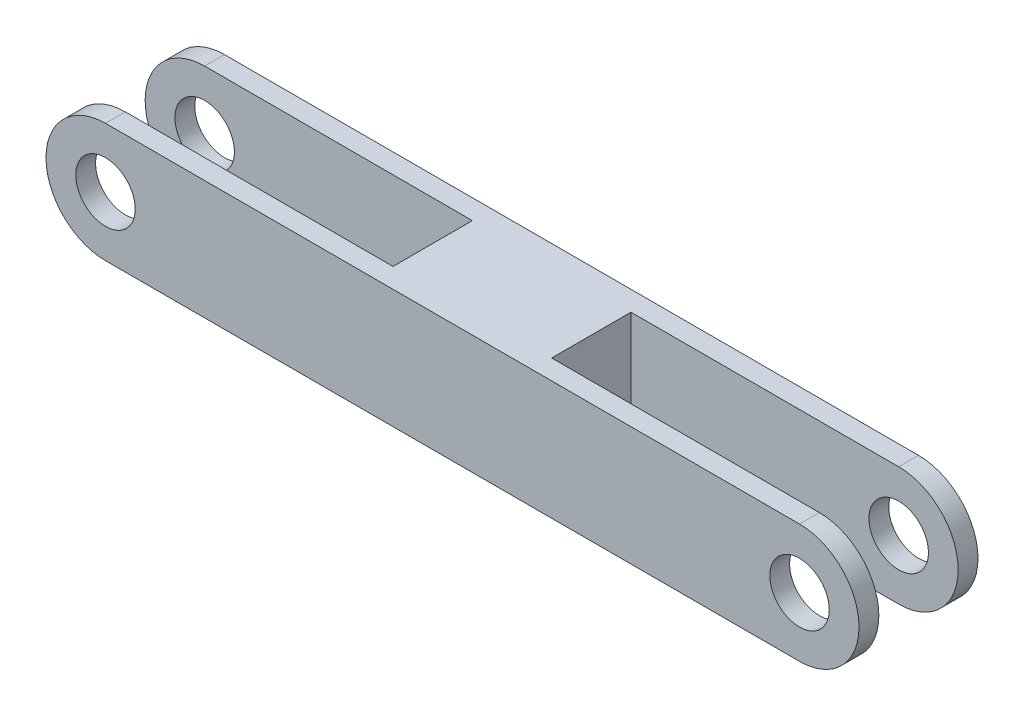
ISO-10303-21;
HEADER;
FILE_DESCRIPTION(('STEP AP214'),'2;1');
FILE_NAME('part.step','',(''),(''),'','','');
FILE_SCHEMA(('AUTOMOTIVE_DESIGN { 1 0 10303 214 1 1 1 1 }'));
ENDSEC;
DATA;
#1=APPLICATION_CONTEXT('core data for automotive mechanical design processes');
#2=APPLICATION_PROTOCOL_DEFINITION('international standard','automotive_design',2000,#1);
#3=PRODUCT_CONTEXT('',#1,'mechanical');
#4=PRODUCT('Part','Part','',(#3));
#5=PRODUCT_RELATED_PRODUCT_CATEGORY('part','',(#4));
#6=PRODUCT_DEFINITION_FORMATION('','',#4);
#7=PRODUCT_DEFINITION_CONTEXT('part definition',#1,'design');
#8=PRODUCT_DEFINITION('design','',#6,#7);
#9=PRODUCT_DEFINITION_SHAPE('','',#8);
#10=(LENGTH_UNIT() NAMED_UNIT(*) SI_UNIT(.MILLI.,.METRE.));
#11=(NAMED_UNIT(*) PLANE_ANGLE_UNIT() SI_UNIT($,.RADIAN.));
#12=(NAMED_UNIT(*) SI_UNIT($,.STERADIAN.) SOLID_ANGLE_UNIT());
#13=UNCERTAINTY_MEASURE_WITH_UNIT(LENGTH_MEASURE(1.E-05),#10,'distance_accuracy_value','');
#14=(GEOMETRIC_REPRESENTATION_CONTEXT(3) GLOBAL_UNCERTAINTY_ASSIGNED_CONTEXT((#13)) GLOBAL_UNIT_ASSIGNED_CONTEXT((#10,
#11,#12)) REPRESENTATION_CONTEXT('',''));
#15=CARTESIAN_POINT('',(0.,0.,0.));
#16=DIRECTION('',(0.,0.,1.));
#17=DIRECTION('',(1.,0.,0.));
#18=AXIS2_PLACEMENT_3D('',#15,#16,#17);
#19=CARTESIAN_POINT('',(0.,0.,3.));
#20=DIRECTION('',(0.,0.,-1.));
#21=DIRECTION('',(-1.,0.,0.));
#22=AXIS2_PLACEMENT_3D('',#19,#20,#21);
#23=CYLINDRICAL_SURFACE('',#22,3.);
#24=DIRECTION('',(0.,0.,-1.));
#25=VECTOR('',#24,1.);
#26=CARTESIAN_POINT('',(0.,3.,3.));
#27=LINE('',#26,#25);
#28=CARTESIAN_POINT('',(0.,3.,3.));
#29=VERTEX_POINT('',#28);
#30=CARTESIAN_POINT('',(0.,3.,2.));
#31=VERTEX_POINT('',#30);
#32=EDGE_CURVE('E139',#29,#31,#27,.T.);
#33=ORIENTED_EDGE('',*,*,#32,.T.);
#34=CARTESIAN_POINT('',(0.,0.,2.));
#35=DIRECTION('',(0.,0.,1.));
#36=DIRECTION('',(1.,0.,0.));
#37=AXIS2_PLACEMENT_3D('',#34,#35,#36);
#38=CIRCLE('',#37,3.);
#39=CARTESIAN_POINT('',(0.,-3.,2.));
#40=VERTEX_POINT('',#39);
#41=EDGE_CURVE('E127',#40,#31,#38,.F.);
#42=ORIENTED_EDGE('',*,*,#41,.F.);
#43=DIRECTION('',(0.,0.,-1.));
#44=VECTOR('',#43,1.);
#45=CARTESIAN_POINT('',(0.,-3.,3.));
#46=LINE('',#45,#44);
#47=CARTESIAN_POINT('',(0.,-3.,3.));
#48=VERTEX_POINT('',#47);
#49=EDGE_CURVE('E11',#48,#40,#46,.T.);
#50=ORIENTED_EDGE('',*,*,#49,.F.);
#51=CARTESIAN_POINT('',(0.,0.,3.));
#52=DIRECTION('',(0.,0.,1.));
#53=DIRECTION('',(-1.,0.,0.));
#54=AXIS2_PLACEMENT_3D('',#51,#52,#53);
#55=CIRCLE('',#54,3.);
#56=EDGE_CURVE('E153',#29,#48,#55,.T.);
#57=ORIENTED_EDGE('',*,*,#56,.F.);
#58=EDGE_LOOP('',(#33,#42,#50,#57));
#59=FACE_BOUND('',#58,.T.);
#60=ADVANCED_FACE('F33',(#59),#23,.T.);
#61=CARTESIAN_POINT('',(0.,0.,3.));
#62=DIRECTION('',(0.,0.,-1.));
#63=DIRECTION('',(-1.,0.,0.));
#64=AXIS2_PLACEMENT_3D('',#61,#62,#63);
#65=CYLINDRICAL_SURFACE('',#64,1.5);
#66=CARTESIAN_POINT('',(0.,0.,2.));
#67=DIRECTION('',(0.,0.,1.));
#68=DIRECTION('',(1.,0.,0.));
#69=AXIS2_PLACEMENT_3D('',#66,#67,#68);
#70=CIRCLE('',#69,1.5);
#71=CARTESIAN_POINT('',(1.5,0.,2.));
#72=VERTEX_POINT('',#71);
#73=EDGE_CURVE('E243',#72,#72,#70,.F.);
#74=ORIENTED_EDGE('',*,*,#73,.T.);
#75=EDGE_LOOP('',(#74));
#76=FACE_BOUND('',#75,.T.);
#77=CARTESIAN_POINT('',(0.,0.,3.));
#78=DIRECTION('',(0.,0.,1.));
#79=DIRECTION('',(1.,0.,0.));
#80=AXIS2_PLACEMENT_3D('',#77,#78,#79);
#81=CIRCLE('',#80,1.5);
#82=CARTESIAN_POINT('',(1.5,0.,3.));
#83=VERTEX_POINT('',#82);
#84=EDGE_CURVE('E200',#83,#83,#81,.T.);
#85=ORIENTED_EDGE('',*,*,#84,.T.);
#86=EDGE_LOOP('',(#85));
#87=FACE_BOUND('',#86,.T.);
#88=ADVANCED_FACE('F283',(#76,#87),#65,.F.);
#89=CARTESIAN_POINT('',(35.,0.,3.));
#90=DIRECTION('',(0.,0.,-1.));
#91=DIRECTION('',(-1.,0.,0.));
#92=AXIS2_PLACEMENT_3D('',#89,#90,#91);
#93=CYLINDRICAL_SURFACE('',#92,3.);
#94=DIRECTION('',(0.,0.,-1.));
#95=VECTOR('',#94,1.);
#96=CARTESIAN_POINT('',(35.,3.,3.));
#97=LINE('',#96,#95);
#98=CARTESIAN_POINT('',(35.,3.,-2.));
#99=VERTEX_POINT('',#98);
#100=CARTESIAN_POINT('',(35.,3.,-3.));
#101=VERTEX_POINT('',#100);
#102=EDGE_CURVE('E170',#99,#101,#97,.T.);
#103=ORIENTED_EDGE('',*,*,#102,.F.);
#104=CARTESIAN_POINT('',(35.,0.,-2.));
#105=DIRECTION('',(0.,0.,-1.));
#106=DIRECTION('',(-1.,0.,0.));
#107=AXIS2_PLACEMENT_3D('',#104,#105,#106);
#108=CIRCLE('',#107,3.);
#109=CARTESIAN_POINT('',(35.,-3.,-2.));
#110=VERTEX_POINT('',#109);
#111=EDGE_CURVE('E185',#110,#99,#108,.F.);
#112=ORIENTED_EDGE('',*,*,#111,.F.);
#113=DIRECTION('',(0.,0.,-1.));
#114=VECTOR('',#113,1.);
#115=CARTESIAN_POINT('',(35.,-3.,3.));
#116=LINE('',#115,#114);
#117=CARTESIAN_POINT('',(35.,-3.,-3.));
#118=VERTEX_POINT('',#117);
#119=EDGE_CURVE('E173',#110,#118,#116,.T.);
#120=ORIENTED_EDGE('',*,*,#119,.T.);
#121=CARTESIAN_POINT('',(35.,0.,-3.));
#122=DIRECTION('',(0.,0.,1.));
#123=DIRECTION('',(1.,0.,0.));
#124=AXIS2_PLACEMENT_3D('',#121,#122,#123);
#125=CIRCLE('',#124,3.);
#126=EDGE_CURVE('E162',#118,#101,#125,.T.);
#127=ORIENTED_EDGE('',*,*,#126,.T.);
#128=EDGE_LOOP('',(#103,#112,#120,#127));
#129=FACE_BOUND('',#128,.T.);
#130=ADVANCED_FACE('F182',(#129),#93,.T.);
#131=CARTESIAN_POINT('',(35.,0.,3.));
#132=DIRECTION('',(0.,0.,-1.));
#133=DIRECTION('',(-1.,0.,0.));
#134=AXIS2_PLACEMENT_3D('',#131,#132,#133);
#135=CYLINDRICAL_SURFACE('',#134,1.5);
#136=CARTESIAN_POINT('',(35.,0.,-2.));
#137=DIRECTION('',(0.,0.,-1.));
#138=DIRECTION('',(-1.,0.,0.));
#139=AXIS2_PLACEMENT_3D('',#136,#137,#138);
#140=CIRCLE('',#139,1.5);
#141=CARTESIAN_POINT('',(33.5,0.,-2.));
#142=VERTEX_POINT('',#141);
#143=EDGE_CURVE('E219',#142,#142,#140,.F.);
#144=ORIENTED_EDGE('',*,*,#143,.T.);
#145=EDGE_LOOP('',(#144));
#146=FACE_BOUND('',#145,.T.);
#147=CARTESIAN_POINT('',(35.,0.,-3.));
#148=DIRECTION('',(0.,0.,1.));
#149=DIRECTION('',(1.,0.,0.));
#150=AXIS2_PLACEMENT_3D('',#147,#148,#149);
#151=CIRCLE('',#150,1.5);
#152=CARTESIAN_POINT('',(36.5,0.,-3.));
#153=VERTEX_POINT('',#152);
#154=EDGE_CURVE('E209',#153,#153,#151,.T.);
#155=ORIENTED_EDGE('',*,*,#154,.F.);
#156=EDGE_LOOP('',(#155));
#157=FACE_BOUND('',#156,.T.);
#158=ADVANCED_FACE('F282',(#146,#157),#135,.F.);
#159=CARTESIAN_POINT('',(0.,0.,3.));
#160=DIRECTION('',(0.,0.,-1.));
#161=DIRECTION('',(-1.,0.,0.));
#162=AXIS2_PLACEMENT_3D('',#159,#160,#161);
#163=PLANE('',#162);
#164=ORIENTED_EDGE('',*,*,#84,.F.);
#165=EDGE_LOOP('',(#164));
#166=FACE_BOUND('',#165,.T.);
#167=ORIENTED_EDGE('',*,*,#56,.T.);
#168=DIRECTION('',(1.,0.,0.));
#169=VECTOR('',#168,1.);
#170=CARTESIAN_POINT('',(0.,-3.,3.));
#171=LINE('',#170,#169);
#172=CARTESIAN_POINT('',(35.,-3.,3.));
#173=VERTEX_POINT('',#172);
#174=EDGE_CURVE('E145',#48,#173,#171,.T.);
#175=ORIENTED_EDGE('',*,*,#174,.T.);
#176=CARTESIAN_POINT('',(35.,0.,3.));
#177=DIRECTION('',(0.,0.,1.));
#178=DIRECTION('',(1.,0.,0.));
#179=AXIS2_PLACEMENT_3D('',#176,#177,#178);
#180=CIRCLE('',#179,3.);
#181=CARTESIAN_POINT('',(35.,3.,3.));
#182=VERTEX_POINT('',#181);
#183=EDGE_CURVE('E152',#173,#182,#180,.T.);
#184=ORIENTED_EDGE('',*,*,#183,.T.);
#185=DIRECTION('',(-1.,0.,0.));
#186=VECTOR('',#185,1.);
#187=CARTESIAN_POINT('',(0.,3.,3.));
#188=LINE('',#187,#186);
#189=EDGE_CURVE('E158',#182,#29,#188,.T.);
#190=ORIENTED_EDGE('',*,*,#189,.T.);
#191=EDGE_LOOP('',(#167,#175,#184,#190));
#192=FACE_BOUND('',#191,.T.);
#193=CARTESIAN_POINT('',(35.,0.,3.));
#194=DIRECTION('',(0.,0.,1.));
#195=DIRECTION('',(1.,0.,0.));
#196=AXIS2_PLACEMENT_3D('',#193,#194,#195);
#197=CIRCLE('',#196,1.5);
#198=CARTESIAN_POINT('',(36.5,0.,3.));
#199=VERTEX_POINT('',#198);
#200=EDGE_CURVE('E206',#199,#199,#197,.T.);
#201=ORIENTED_EDGE('',*,*,#200,.F.);
#202=EDGE_LOOP('',(#201));
#203=FACE_BOUND('',#202,.T.);
#204=ADVANCED_FACE('F155',(#166,#192,#203),#163,.F.);
#205=CARTESIAN_POINT('',(0.,0.,-3.));
#206=DIRECTION('',(0.,0.,-1.));
#207=DIRECTION('',(-1.,0.,0.));
#208=AXIS2_PLACEMENT_3D('',#205,#206,#207);
#209=PLANE('',#208);
#210=CARTESIAN_POINT('',(0.,0.,-3.));
#211=DIRECTION('',(0.,0.,1.));
#212=DIRECTION('',(1.,0.,0.));
#213=AXIS2_PLACEMENT_3D('',#210,#211,#212);
#214=CIRCLE('',#213,1.5);
#215=CARTESIAN_POINT('',(1.5,0.,-3.));
#216=VERTEX_POINT('',#215);
#217=EDGE_CURVE('E203',#216,#216,#214,.T.);
#218=ORIENTED_EDGE('',*,*,#217,.T.);
#219=EDGE_LOOP('',(#218));
#220=FACE_BOUND('',#219,.T.);
#221=CARTESIAN_POINT('',(0.,0.,-3.));
#222=DIRECTION('',(0.,0.,1.));
#223=DIRECTION('',(-1.,0.,0.));
#224=AXIS2_PLACEMENT_3D('',#221,#222,#223);
#225=CIRCLE('',#224,3.);
#226=CARTESIAN_POINT('',(0.,3.,-3.));
#227=VERTEX_POINT('',#226);
#228=CARTESIAN_POINT('',(0.,-3.,-3.));
#229=VERTEX_POINT('',#228);
#230=EDGE_CURVE('E194',#227,#229,#225,.T.);
#231=ORIENTED_EDGE('',*,*,#230,.F.);
#232=DIRECTION('',(-1.,0.,0.));
#233=VECTOR('',#232,1.);
#234=CARTESIAN_POINT('',(0.,3.,-3.));
#235=LINE('',#234,#233);
#236=EDGE_CURVE('E159',#101,#227,#235,.T.);
#237=ORIENTED_EDGE('',*,*,#236,.F.);
#238=ORIENTED_EDGE('',*,*,#126,.F.);
#239=DIRECTION('',(1.,0.,0.));
#240=VECTOR('',#239,1.);
#241=CARTESIAN_POINT('',(0.,-3.,-3.));
#242=LINE('',#241,#240);
#243=EDGE_CURVE('E188',#229,#118,#242,.T.);
#244=ORIENTED_EDGE('',*,*,#243,.F.);
#245=EDGE_LOOP('',(#231,#237,#238,#244));
#246=FACE_BOUND('',#245,.T.);
#247=ORIENTED_EDGE('',*,*,#154,.T.);
#248=EDGE_LOOP('',(#247));
#249=FACE_BOUND('',#248,.T.);
#250=ADVANCED_FACE('F196',(#220,#246,#249),#209,.T.);
#251=CARTESIAN_POINT('',(0.,-3.,-2.));
#252=VERTEX_POINT('',#251);
#253=EDGE_CURVE('E41',#252,#229,#46,.T.);
#254=ORIENTED_EDGE('',*,*,#253,.F.);
#255=CARTESIAN_POINT('',(0.,0.,-2.));
#256=DIRECTION('',(0.,0.,-1.));
#257=DIRECTION('',(-1.,0.,0.));
#258=AXIS2_PLACEMENT_3D('',#255,#256,#257);
#259=CIRCLE('',#258,3.);
#260=CARTESIAN_POINT('',(0.,3.,-2.));
#261=VERTEX_POINT('',#260);
#262=EDGE_CURVE('E141',#261,#252,#259,.F.);
#263=ORIENTED_EDGE('',*,*,#262,.F.);
#264=EDGE_CURVE('E168',#261,#227,#27,.T.);
#265=ORIENTED_EDGE('',*,*,#264,.T.);
#266=ORIENTED_EDGE('',*,*,#230,.T.);
#267=EDGE_LOOP('',(#254,#263,#265,#266));
#268=FACE_BOUND('',#267,.T.);
#269=ADVANCED_FACE('F35',(#268),#23,.T.);
#270=CARTESIAN_POINT('',(0.,-3.,3.));
#271=DIRECTION('',(0.,1.,0.));
#272=DIRECTION('',(0.,0.,1.));
#273=AXIS2_PLACEMENT_3D('',#270,#271,#272);
#274=PLANE('',#273);
#275=ORIENTED_EDGE('',*,*,#49,.T.);
#276=DIRECTION('',(-1.,0.,0.));
#277=VECTOR('',#276,1.);
#278=CARTESIAN_POINT('',(13.5,-3.,2.));
#279=LINE('',#278,#277);
#280=CARTESIAN_POINT('',(13.5,-3.,2.));
#281=VERTEX_POINT('',#280);
#282=EDGE_CURVE('E123',#281,#40,#279,.T.);
#283=ORIENTED_EDGE('',*,*,#282,.F.);
#284=DIRECTION('',(0.,0.,1.));
#285=VECTOR('',#284,1.);
#286=CARTESIAN_POINT('',(13.5,-3.,-2.));
#287=LINE('',#286,#285);
#288=CARTESIAN_POINT('',(13.5,-3.,-2.));
#289=VERTEX_POINT('',#288);
#290=EDGE_CURVE('E132',#289,#281,#287,.T.);
#291=ORIENTED_EDGE('',*,*,#290,.F.);
#292=DIRECTION('',(1.,0.,0.));
#293=VECTOR('',#292,1.);
#294=CARTESIAN_POINT('',(-3.,-3.,-2.));
#295=LINE('',#294,#293);
#296=EDGE_CURVE('E239',#252,#289,#295,.T.);
#297=ORIENTED_EDGE('',*,*,#296,.F.);
#298=ORIENTED_EDGE('',*,*,#253,.T.);
#299=ORIENTED_EDGE('',*,*,#243,.T.);
#300=ORIENTED_EDGE('',*,*,#119,.F.);
#301=DIRECTION('',(1.,0.,0.));
#302=VECTOR('',#301,1.);
#303=CARTESIAN_POINT('',(38.,-3.,-2.));
#304=LINE('',#303,#302);
#305=CARTESIAN_POINT('',(21.5,-3.,-2.));
#306=VERTEX_POINT('',#305);
#307=EDGE_CURVE('E229',#306,#110,#304,.T.);
#308=ORIENTED_EDGE('',*,*,#307,.F.);
#309=DIRECTION('',(0.,0.,-1.));
#310=VECTOR('',#309,1.);
#311=CARTESIAN_POINT('',(21.5,-3.,-2.));
#312=LINE('',#311,#310);
#313=CARTESIAN_POINT('',(21.5,-3.,2.));
#314=VERTEX_POINT('',#313);
#315=EDGE_CURVE('E231',#314,#306,#312,.T.);
#316=ORIENTED_EDGE('',*,*,#315,.F.);
#317=DIRECTION('',(-1.,0.,0.));
#318=VECTOR('',#317,1.);
#319=CARTESIAN_POINT('',(21.5,-3.,2.));
#320=LINE('',#319,#318);
#321=CARTESIAN_POINT('',(35.,-3.,2.));
#322=VERTEX_POINT('',#321);
#323=EDGE_CURVE('E212',#322,#314,#320,.T.);
#324=ORIENTED_EDGE('',*,*,#323,.F.);
#325=EDGE_CURVE('E149',#173,#322,#116,.T.);
#326=ORIENTED_EDGE('',*,*,#325,.F.);
#327=ORIENTED_EDGE('',*,*,#174,.F.);
#328=EDGE_LOOP('',(#275,#283,#291,#297,#298,#299,#300,#308,#316,#324,#326,#327));
#329=FACE_BOUND('',#328,.T.);
#330=ADVANCED_FACE('F143',(#329),#274,.F.);
#331=ORIENTED_EDGE('',*,*,#325,.T.);
#332=CARTESIAN_POINT('',(35.,0.,2.));
#333=DIRECTION('',(0.,0.,1.));
#334=DIRECTION('',(1.,0.,0.));
#335=AXIS2_PLACEMENT_3D('',#332,#333,#334);
#336=CIRCLE('',#335,3.);
#337=CARTESIAN_POINT('',(35.,3.,2.));
#338=VERTEX_POINT('',#337);
#339=EDGE_CURVE('E237',#338,#322,#336,.F.);
#340=ORIENTED_EDGE('',*,*,#339,.F.);
#341=EDGE_CURVE('E171',#182,#338,#97,.T.);
#342=ORIENTED_EDGE('',*,*,#341,.F.);
#343=ORIENTED_EDGE('',*,*,#183,.F.);
#344=EDGE_LOOP('',(#331,#340,#342,#343));
#345=FACE_BOUND('',#344,.T.);
#346=ADVANCED_FACE('F272',(#345),#93,.T.);
#347=CARTESIAN_POINT('',(0.,3.,3.));
#348=DIRECTION('',(0.,-1.,0.));
#349=DIRECTION('',(0.,0.,-1.));
#350=AXIS2_PLACEMENT_3D('',#347,#348,#349);
#351=PLANE('',#350);
#352=DIRECTION('',(0.,0.,-1.));
#353=VECTOR('',#352,1.);
#354=CARTESIAN_POINT('',(13.5,3.,-2.));
#355=LINE('',#354,#353);
#356=CARTESIAN_POINT('',(13.5,3.,2.));
#357=VERTEX_POINT('',#356);
#358=CARTESIAN_POINT('',(13.5,3.,-2.));
#359=VERTEX_POINT('',#358);
#360=EDGE_CURVE('E48',#357,#359,#355,.T.);
#361=ORIENTED_EDGE('',*,*,#360,.F.);
#362=DIRECTION('',(1.,0.,0.));
#363=VECTOR('',#362,1.);
#364=CARTESIAN_POINT('',(13.5,3.,2.));
#365=LINE('',#364,#363);
#366=EDGE_CURVE('E246',#31,#357,#365,.T.);
#367=ORIENTED_EDGE('',*,*,#366,.F.);
#368=ORIENTED_EDGE('',*,*,#32,.F.);
#369=ORIENTED_EDGE('',*,*,#189,.F.);
#370=ORIENTED_EDGE('',*,*,#341,.T.);
#371=DIRECTION('',(1.,0.,0.));
#372=VECTOR('',#371,1.);
#373=CARTESIAN_POINT('',(21.5,3.,2.));
#374=LINE('',#373,#372);
#375=CARTESIAN_POINT('',(21.5,3.,2.));
#376=VERTEX_POINT('',#375);
#377=EDGE_CURVE('E226',#376,#338,#374,.T.);
#378=ORIENTED_EDGE('',*,*,#377,.F.);
#379=DIRECTION('',(0.,0.,1.));
#380=VECTOR('',#379,1.);
#381=CARTESIAN_POINT('',(21.5,3.,-2.));
#382=LINE('',#381,#380);
#383=CARTESIAN_POINT('',(21.5,3.,-2.));
#384=VERTEX_POINT('',#383);
#385=EDGE_CURVE('E56',#384,#376,#382,.T.);
#386=ORIENTED_EDGE('',*,*,#385,.F.);
#387=DIRECTION('',(-1.,0.,0.));
#388=VECTOR('',#387,1.);
#389=CARTESIAN_POINT('',(38.,3.,-2.));
#390=LINE('',#389,#388);
#391=EDGE_CURVE('E222',#99,#384,#390,.T.);
#392=ORIENTED_EDGE('',*,*,#391,.F.);
#393=ORIENTED_EDGE('',*,*,#102,.T.);
#394=ORIENTED_EDGE('',*,*,#236,.T.);
#395=ORIENTED_EDGE('',*,*,#264,.F.);
#396=DIRECTION('',(-1.,0.,0.));
#397=VECTOR('',#396,1.);
#398=CARTESIAN_POINT('',(-3.,3.,-2.));
#399=LINE('',#398,#397);
#400=EDGE_CURVE('E249',#359,#261,#399,.T.);
#401=ORIENTED_EDGE('',*,*,#400,.F.);
#402=EDGE_LOOP('',(#361,#367,#368,#369,#370,#378,#386,#392,#393,#394,#395,#401));
#403=FACE_BOUND('',#402,.T.);
#404=ADVANCED_FACE('F262',(#403),#351,.F.);
#405=CARTESIAN_POINT('',(0.,0.,-2.));
#406=DIRECTION('',(0.,0.,-1.));
#407=DIRECTION('',(-1.,0.,0.));
#408=AXIS2_PLACEMENT_3D('',#405,#406,#407);
#409=CIRCLE('',#408,1.5);
#410=CARTESIAN_POINT('',(-1.5,0.,-2.));
#411=VERTEX_POINT('',#410);
#412=EDGE_CURVE('E140',#411,#411,#409,.F.);
#413=ORIENTED_EDGE('',*,*,#412,.T.);
#414=EDGE_LOOP('',(#413));
#415=FACE_BOUND('',#414,.T.);
#416=ORIENTED_EDGE('',*,*,#217,.F.);
#417=EDGE_LOOP('',(#416));
#418=FACE_BOUND('',#417,.T.);
#419=ADVANCED_FACE('F279',(#415,#418),#65,.F.);
#420=CARTESIAN_POINT('',(35.,0.,2.));
#421=DIRECTION('',(0.,0.,1.));
#422=DIRECTION('',(1.,0.,0.));
#423=AXIS2_PLACEMENT_3D('',#420,#421,#422);
#424=CIRCLE('',#423,1.5);
#425=CARTESIAN_POINT('',(36.5,0.,2.));
#426=VERTEX_POINT('',#425);
#427=EDGE_CURVE('E216',#426,#426,#424,.F.);
#428=ORIENTED_EDGE('',*,*,#427,.T.);
#429=EDGE_LOOP('',(#428));
#430=FACE_BOUND('',#429,.T.);
#431=ORIENTED_EDGE('',*,*,#200,.T.);
#432=EDGE_LOOP('',(#431));
#433=FACE_BOUND('',#432,.T.);
#434=ADVANCED_FACE('F303',(#430,#433),#135,.F.);
#435=CARTESIAN_POINT('',(21.5,-3.001,-2.));
#436=DIRECTION('',(-1.,0.,0.));
#437=DIRECTION('',(0.,0.,1.));
#438=AXIS2_PLACEMENT_3D('',#435,#436,#437);
#439=PLANE('',#438);
#440=ORIENTED_EDGE('',*,*,#315,.T.);
#441=DIRECTION('',(0.,1.,0.));
#442=VECTOR('',#441,1.);
#443=CARTESIAN_POINT('',(21.5,-3.001,-2.));
#444=LINE('',#443,#442);
#445=EDGE_CURVE('E215',#306,#384,#444,.T.);
#446=ORIENTED_EDGE('',*,*,#445,.T.);
#447=ORIENTED_EDGE('',*,*,#385,.T.);
#448=DIRECTION('',(0.,1.,0.));
#449=VECTOR('',#448,1.);
#450=CARTESIAN_POINT('',(21.5,-3.001,2.));
#451=LINE('',#450,#449);
#452=EDGE_CURVE('E220',#314,#376,#451,.T.);
#453=ORIENTED_EDGE('',*,*,#452,.F.);
#454=EDGE_LOOP('',(#440,#446,#447,#453));
#455=FACE_BOUND('',#454,.T.);
#456=ADVANCED_FACE('F268',(#455),#439,.F.);
#457=CARTESIAN_POINT('',(38.,-3.001,-2.));
#458=DIRECTION('',(0.,0.,-1.));
#459=DIRECTION('',(-1.,0.,0.));
#460=AXIS2_PLACEMENT_3D('',#457,#458,#459);
#461=PLANE('',#460);
#462=ORIENTED_EDGE('',*,*,#143,.F.);
#463=EDGE_LOOP('',(#462));
#464=FACE_BOUND('',#463,.T.);
#465=ORIENTED_EDGE('',*,*,#307,.T.);
#466=ORIENTED_EDGE('',*,*,#111,.T.);
#467=ORIENTED_EDGE('',*,*,#391,.T.);
#468=ORIENTED_EDGE('',*,*,#445,.F.);
#469=EDGE_LOOP('',(#465,#466,#467,#468));
#470=FACE_BOUND('',#469,.T.);
#471=ADVANCED_FACE('F266',(#464,#470),#461,.F.);
#472=CARTESIAN_POINT('',(21.5,-3.001,2.));
#473=DIRECTION('',(0.,0.,1.));
#474=DIRECTION('',(1.,0.,0.));
#475=AXIS2_PLACEMENT_3D('',#472,#473,#474);
#476=PLANE('',#475);
#477=ORIENTED_EDGE('',*,*,#427,.F.);
#478=EDGE_LOOP('',(#477));
#479=FACE_BOUND('',#478,.T.);
#480=ORIENTED_EDGE('',*,*,#323,.T.);
#481=ORIENTED_EDGE('',*,*,#452,.T.);
#482=ORIENTED_EDGE('',*,*,#377,.T.);
#483=ORIENTED_EDGE('',*,*,#339,.T.);
#484=EDGE_LOOP('',(#480,#481,#482,#483));
#485=FACE_BOUND('',#484,.T.);
#486=ADVANCED_FACE('F270',(#479,#485),#476,.F.);
#487=CARTESIAN_POINT('',(13.5,-3.001,-2.));
#488=DIRECTION('',(1.,0.,0.));
#489=DIRECTION('',(0.,0.,-1.));
#490=AXIS2_PLACEMENT_3D('',#487,#488,#489);
#491=PLANE('',#490);
#492=ORIENTED_EDGE('',*,*,#290,.T.);
#493=DIRECTION('',(0.,1.,0.));
#494=VECTOR('',#493,1.);
#495=CARTESIAN_POINT('',(13.5,-3.001,2.));
#496=LINE('',#495,#494);
#497=EDGE_CURVE('E129',#281,#357,#496,.T.);
#498=ORIENTED_EDGE('',*,*,#497,.T.);
#499=ORIENTED_EDGE('',*,*,#360,.T.);
#500=DIRECTION('',(0.,1.,0.));
#501=VECTOR('',#500,1.);
#502=CARTESIAN_POINT('',(13.5,-3.001,-2.));
#503=LINE('',#502,#501);
#504=EDGE_CURVE('E244',#289,#359,#503,.T.);
#505=ORIENTED_EDGE('',*,*,#504,.F.);
#506=EDGE_LOOP('',(#492,#498,#499,#505));
#507=FACE_BOUND('',#506,.T.);
#508=ADVANCED_FACE('F312',(#507),#491,.F.);
#509=CARTESIAN_POINT('',(13.5,-3.001,2.));
#510=DIRECTION('',(0.,0.,1.));
#511=DIRECTION('',(1.,0.,0.));
#512=AXIS2_PLACEMENT_3D('',#509,#510,#511);
#513=PLANE('',#512);
#514=ORIENTED_EDGE('',*,*,#73,.F.);
#515=EDGE_LOOP('',(#514));
#516=FACE_BOUND('',#515,.T.);
#517=ORIENTED_EDGE('',*,*,#41,.T.);
#518=ORIENTED_EDGE('',*,*,#366,.T.);
#519=ORIENTED_EDGE('',*,*,#497,.F.);
#520=ORIENTED_EDGE('',*,*,#282,.T.);
#521=EDGE_LOOP('',(#517,#518,#519,#520));
#522=FACE_BOUND('',#521,.T.);
#523=ADVANCED_FACE('F125',(#516,#522),#513,.F.);
#524=CARTESIAN_POINT('',(-3.,-3.001,-2.));
#525=DIRECTION('',(0.,0.,-1.));
#526=DIRECTION('',(-1.,0.,0.));
#527=AXIS2_PLACEMENT_3D('',#524,#525,#526);
#528=PLANE('',#527);
#529=ORIENTED_EDGE('',*,*,#412,.F.);
#530=EDGE_LOOP('',(#529));
#531=FACE_BOUND('',#530,.T.);
#532=ORIENTED_EDGE('',*,*,#262,.T.);
#533=ORIENTED_EDGE('',*,*,#296,.T.);
#534=ORIENTED_EDGE('',*,*,#504,.T.);
#535=ORIENTED_EDGE('',*,*,#400,.T.);
#536=EDGE_LOOP('',(#532,#533,#534,#535));
#537=FACE_BOUND('',#536,.T.);
#538=ADVANCED_FACE('F257',(#531,#537),#528,.F.);
#539=CLOSED_SHELL('',(#60,#88,#130,#158,#204,#250,#269,#330,#346,#404,#419,#434,#456,#471,#486,
#508,#523,#538));
#540=MANIFOLD_SOLID_BREP('B2',#539);
#541=ADVANCED_BREP_SHAPE_REPRESENTATION('',(#18,#540),#14);
#542=SHAPE_DEFINITION_REPRESENTATION(#9,#541);
ENDSEC;
END-ISO-10303-21;
